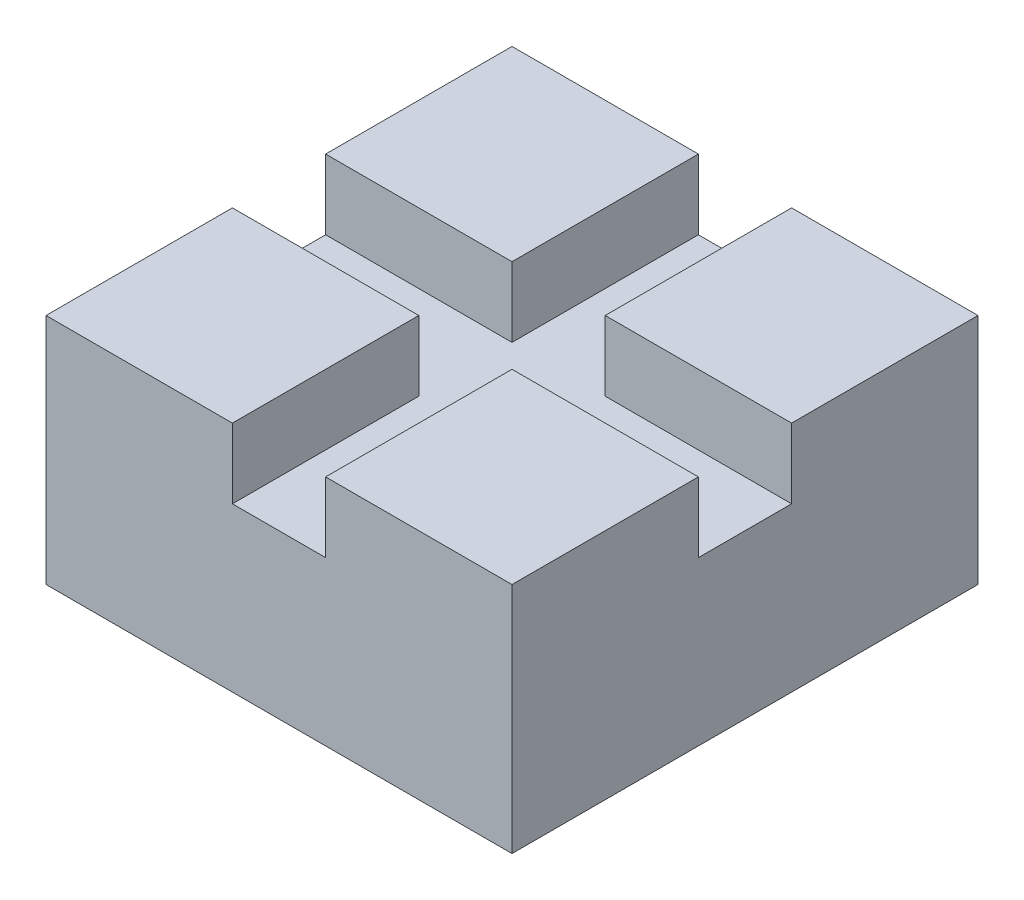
ISO-10303-21;
HEADER;
FILE_DESCRIPTION(('STEP AP214'),'2;1');
FILE_NAME('part.step','',(''),(''),'','','');
FILE_SCHEMA(('AUTOMOTIVE_DESIGN { 1 0 10303 214 1 1 1 1 }'));
ENDSEC;
DATA;
#1=APPLICATION_CONTEXT('core data for automotive mechanical design processes');
#2=APPLICATION_PROTOCOL_DEFINITION('international standard','automotive_design',2000,#1);
#3=PRODUCT_CONTEXT('',#1,'mechanical');
#4=PRODUCT('Part','Part','',(#3));
#5=PRODUCT_RELATED_PRODUCT_CATEGORY('part','',(#4));
#6=PRODUCT_DEFINITION_FORMATION('','',#4);
#7=PRODUCT_DEFINITION_CONTEXT('part definition',#1,'design');
#8=PRODUCT_DEFINITION('design','',#6,#7);
#9=PRODUCT_DEFINITION_SHAPE('','',#8);
#10=(LENGTH_UNIT() NAMED_UNIT(*) SI_UNIT(.MILLI.,.METRE.));
#11=(NAMED_UNIT(*) PLANE_ANGLE_UNIT() SI_UNIT($,.RADIAN.));
#12=(NAMED_UNIT(*) SI_UNIT($,.STERADIAN.) SOLID_ANGLE_UNIT());
#13=UNCERTAINTY_MEASURE_WITH_UNIT(LENGTH_MEASURE(1.E-05),#10,'distance_accuracy_value','');
#14=(GEOMETRIC_REPRESENTATION_CONTEXT(3) GLOBAL_UNCERTAINTY_ASSIGNED_CONTEXT((#13)) GLOBAL_UNIT_ASSIGNED_CONTEXT((#10,
#11,#12)) REPRESENTATION_CONTEXT('',''));
#15=CARTESIAN_POINT('',(0.,0.,0.));
#16=DIRECTION('',(0.,0.,1.));
#17=DIRECTION('',(1.,0.,0.));
#18=AXIS2_PLACEMENT_3D('',#15,#16,#17);
#19=CARTESIAN_POINT('',(0.,40.,0.));
#20=DIRECTION('',(0.,-1.,0.));
#21=DIRECTION('',(0.,0.,-1.));
#22=AXIS2_PLACEMENT_3D('',#19,#20,#21);
#23=PLANE('',#22);
#24=DIRECTION('',(0.,0.,1.));
#25=VECTOR('',#24,1.);
#26=CARTESIAN_POINT('',(-8.,40.,-8.));
#27=LINE('',#26,#25);
#28=CARTESIAN_POINT('',(-8.,40.,-40.));
#29=VERTEX_POINT('',#28);
#30=CARTESIAN_POINT('',(-8.,40.,-8.));
#31=VERTEX_POINT('',#30);
#32=EDGE_CURVE('E216',#29,#31,#27,.T.);
#33=ORIENTED_EDGE('',*,*,#32,.F.);
#34=DIRECTION('',(-1.,0.,0.));
#35=VECTOR('',#34,1.);
#36=CARTESIAN_POINT('',(-40.,40.,-40.));
#37=LINE('',#36,#35);
#38=CARTESIAN_POINT('',(-40.,40.,-40.));
#39=VERTEX_POINT('',#38);
#40=EDGE_CURVE('E257',#29,#39,#37,.T.);
#41=ORIENTED_EDGE('',*,*,#40,.T.);
#42=DIRECTION('',(0.,0.,1.));
#43=VECTOR('',#42,1.);
#44=CARTESIAN_POINT('',(-40.,40.,40.));
#45=LINE('',#44,#43);
#46=CARTESIAN_POINT('',(-40.,40.,-8.));
#47=VERTEX_POINT('',#46);
#48=EDGE_CURVE('E262',#39,#47,#45,.T.);
#49=ORIENTED_EDGE('',*,*,#48,.T.);
#50=DIRECTION('',(-1.,0.,0.));
#51=VECTOR('',#50,1.);
#52=CARTESIAN_POINT('',(-40.,40.,-8.));
#53=LINE('',#52,#51);
#54=EDGE_CURVE('E218',#31,#47,#53,.T.);
#55=ORIENTED_EDGE('',*,*,#54,.F.);
#56=EDGE_LOOP('',(#33,#41,#49,#55));
#57=FACE_BOUND('',#56,.T.);
#58=ADVANCED_FACE('F41',(#57),#23,.F.);
#59=DIRECTION('',(1.,0.,0.));
#60=VECTOR('',#59,1.);
#61=CARTESIAN_POINT('',(-8.,40.,8.));
#62=LINE('',#61,#60);
#63=CARTESIAN_POINT('',(-40.,40.,8.));
#64=VERTEX_POINT('',#63);
#65=CARTESIAN_POINT('',(-8.,40.,8.));
#66=VERTEX_POINT('',#65);
#67=EDGE_CURVE('E222',#64,#66,#62,.T.);
#68=ORIENTED_EDGE('',*,*,#67,.F.);
#69=CARTESIAN_POINT('',(-40.,40.,40.));
#70=VERTEX_POINT('',#69);
#71=EDGE_CURVE('E263',#64,#70,#45,.T.);
#72=ORIENTED_EDGE('',*,*,#71,.T.);
#73=DIRECTION('',(1.,0.,0.));
#74=VECTOR('',#73,1.);
#75=CARTESIAN_POINT('',(-40.,40.,40.));
#76=LINE('',#75,#74);
#77=CARTESIAN_POINT('',(-8.,40.,40.));
#78=VERTEX_POINT('',#77);
#79=EDGE_CURVE('E270',#70,#78,#76,.T.);
#80=ORIENTED_EDGE('',*,*,#79,.T.);
#81=DIRECTION('',(0.,0.,1.));
#82=VECTOR('',#81,1.);
#83=CARTESIAN_POINT('',(-8.,40.,40.));
#84=LINE('',#83,#82);
#85=EDGE_CURVE('E221',#66,#78,#84,.T.);
#86=ORIENTED_EDGE('',*,*,#85,.F.);
#87=EDGE_LOOP('',(#68,#72,#80,#86));
#88=FACE_BOUND('',#87,.T.);
#89=ADVANCED_FACE('F312',(#88),#23,.F.);
#90=DIRECTION('',(0.,0.,-1.));
#91=VECTOR('',#90,1.);
#92=CARTESIAN_POINT('',(8.,40.,8.));
#93=LINE('',#92,#91);
#94=CARTESIAN_POINT('',(8.,40.,40.));
#95=VERTEX_POINT('',#94);
#96=CARTESIAN_POINT('',(8.,40.,8.));
#97=VERTEX_POINT('',#96);
#98=EDGE_CURVE('E228',#95,#97,#93,.T.);
#99=ORIENTED_EDGE('',*,*,#98,.F.);
#100=CARTESIAN_POINT('',(40.,40.,40.));
#101=VERTEX_POINT('',#100);
#102=EDGE_CURVE('E61',#95,#101,#76,.T.);
#103=ORIENTED_EDGE('',*,*,#102,.T.);
#104=DIRECTION('',(0.,0.,-1.));
#105=VECTOR('',#104,1.);
#106=CARTESIAN_POINT('',(40.,40.,40.));
#107=LINE('',#106,#105);
#108=CARTESIAN_POINT('',(40.,40.,8.));
#109=VERTEX_POINT('',#108);
#110=EDGE_CURVE('E256',#101,#109,#107,.T.);
#111=ORIENTED_EDGE('',*,*,#110,.T.);
#112=DIRECTION('',(1.,0.,0.));
#113=VECTOR('',#112,1.);
#114=CARTESIAN_POINT('',(40.,40.,8.));
#115=LINE('',#114,#113);
#116=EDGE_CURVE('E230',#97,#109,#115,.T.);
#117=ORIENTED_EDGE('',*,*,#116,.F.);
#118=EDGE_LOOP('',(#99,#103,#111,#117));
#119=FACE_BOUND('',#118,.T.);
#120=ADVANCED_FACE('F301',(#119),#23,.F.);
#121=DIRECTION('',(0.,0.,-1.));
#122=VECTOR('',#121,1.);
#123=CARTESIAN_POINT('',(8.,40.,-40.));
#124=LINE('',#123,#122);
#125=CARTESIAN_POINT('',(8.,40.,-8.));
#126=VERTEX_POINT('',#125);
#127=CARTESIAN_POINT('',(8.,40.,-40.));
#128=VERTEX_POINT('',#127);
#129=EDGE_CURVE('E171',#126,#128,#124,.T.);
#130=ORIENTED_EDGE('',*,*,#129,.F.);
#131=DIRECTION('',(-1.,0.,0.));
#132=VECTOR('',#131,1.);
#133=CARTESIAN_POINT('',(8.,40.,-8.));
#134=LINE('',#133,#132);
#135=CARTESIAN_POINT('',(40.,40.,-8.));
#136=VERTEX_POINT('',#135);
#137=EDGE_CURVE('E189',#136,#126,#134,.T.);
#138=ORIENTED_EDGE('',*,*,#137,.F.);
#139=CARTESIAN_POINT('',(40.,40.,-40.));
#140=VERTEX_POINT('',#139);
#141=EDGE_CURVE('E92',#136,#140,#107,.T.);
#142=ORIENTED_EDGE('',*,*,#141,.T.);
#143=EDGE_CURVE('E261',#140,#128,#37,.T.);
#144=ORIENTED_EDGE('',*,*,#143,.T.);
#145=EDGE_LOOP('',(#130,#138,#142,#144));
#146=FACE_BOUND('',#145,.T.);
#147=ADVANCED_FACE('F306',(#146),#23,.F.);
#148=CARTESIAN_POINT('',(40.,40.,40.));
#149=DIRECTION('',(-1.,0.,0.));
#150=DIRECTION('',(0.,0.,1.));
#151=AXIS2_PLACEMENT_3D('',#148,#149,#150);
#152=PLANE('',#151);
#153=DIRECTION('',(0.,0.,-1.));
#154=VECTOR('',#153,1.);
#155=CARTESIAN_POINT('',(40.,28.,-8.));
#156=LINE('',#155,#154);
#157=CARTESIAN_POINT('',(40.,28.,8.));
#158=VERTEX_POINT('',#157);
#159=CARTESIAN_POINT('',(40.,28.,-8.));
#160=VERTEX_POINT('',#159);
#161=EDGE_CURVE('E215',#158,#160,#156,.T.);
#162=ORIENTED_EDGE('',*,*,#161,.F.);
#163=DIRECTION('',(0.,1.,0.));
#164=VECTOR('',#163,1.);
#165=CARTESIAN_POINT('',(40.,28.,8.));
#166=LINE('',#165,#164);
#167=EDGE_CURVE('E236',#158,#109,#166,.T.);
#168=ORIENTED_EDGE('',*,*,#167,.T.);
#169=ORIENTED_EDGE('',*,*,#110,.F.);
#170=DIRECTION('',(0.,-1.,0.));
#171=VECTOR('',#170,1.);
#172=CARTESIAN_POINT('',(40.,40.,40.));
#173=LINE('',#172,#171);
#174=CARTESIAN_POINT('',(40.,0.,40.));
#175=VERTEX_POINT('',#174);
#176=EDGE_CURVE('E269',#101,#175,#173,.T.);
#177=ORIENTED_EDGE('',*,*,#176,.T.);
#178=DIRECTION('',(0.,0.,-1.));
#179=VECTOR('',#178,1.);
#180=CARTESIAN_POINT('',(40.,0.,40.));
#181=LINE('',#180,#179);
#182=CARTESIAN_POINT('',(40.,0.,-40.));
#183=VERTEX_POINT('',#182);
#184=EDGE_CURVE('E235',#175,#183,#181,.T.);
#185=ORIENTED_EDGE('',*,*,#184,.T.);
#186=DIRECTION('',(0.,-1.,0.));
#187=VECTOR('',#186,1.);
#188=CARTESIAN_POINT('',(40.,40.,-40.));
#189=LINE('',#188,#187);
#190=EDGE_CURVE('E11',#140,#183,#189,.T.);
#191=ORIENTED_EDGE('',*,*,#190,.F.);
#192=ORIENTED_EDGE('',*,*,#141,.F.);
#193=DIRECTION('',(0.,1.,0.));
#194=VECTOR('',#193,1.);
#195=CARTESIAN_POINT('',(40.,28.,-8.));
#196=LINE('',#195,#194);
#197=EDGE_CURVE('E237',#160,#136,#196,.T.);
#198=ORIENTED_EDGE('',*,*,#197,.F.);
#199=EDGE_LOOP('',(#162,#168,#169,#177,#185,#191,#192,#198));
#200=FACE_BOUND('',#199,.T.);
#201=ADVANCED_FACE('F43',(#200),#152,.F.);
#202=CARTESIAN_POINT('',(-40.,40.,-40.));
#203=DIRECTION('',(0.,0.,1.));
#204=DIRECTION('',(1.,0.,0.));
#205=AXIS2_PLACEMENT_3D('',#202,#203,#204);
#206=PLANE('',#205);
#207=DIRECTION('',(-1.,0.,0.));
#208=VECTOR('',#207,1.);
#209=CARTESIAN_POINT('',(-8.,28.,-40.));
#210=LINE('',#209,#208);
#211=CARTESIAN_POINT('',(8.,28.,-40.));
#212=VERTEX_POINT('',#211);
#213=CARTESIAN_POINT('',(-8.,28.,-40.));
#214=VERTEX_POINT('',#213);
#215=EDGE_CURVE('E184',#212,#214,#210,.T.);
#216=ORIENTED_EDGE('',*,*,#215,.F.);
#217=DIRECTION('',(0.,1.,0.));
#218=VECTOR('',#217,1.);
#219=CARTESIAN_POINT('',(8.,28.,-40.));
#220=LINE('',#219,#218);
#221=EDGE_CURVE('E166',#212,#128,#220,.T.);
#222=ORIENTED_EDGE('',*,*,#221,.T.);
#223=ORIENTED_EDGE('',*,*,#143,.F.);
#224=ORIENTED_EDGE('',*,*,#190,.T.);
#225=DIRECTION('',(-1.,0.,0.));
#226=VECTOR('',#225,1.);
#227=CARTESIAN_POINT('',(-40.,0.,-40.));
#228=LINE('',#227,#226);
#229=CARTESIAN_POINT('',(-40.,0.,-40.));
#230=VERTEX_POINT('',#229);
#231=EDGE_CURVE('E272',#183,#230,#228,.T.);
#232=ORIENTED_EDGE('',*,*,#231,.T.);
#233=DIRECTION('',(0.,-1.,0.));
#234=VECTOR('',#233,1.);
#235=CARTESIAN_POINT('',(-40.,40.,-40.));
#236=LINE('',#235,#234);
#237=EDGE_CURVE('E47',#39,#230,#236,.T.);
#238=ORIENTED_EDGE('',*,*,#237,.F.);
#239=ORIENTED_EDGE('',*,*,#40,.F.);
#240=DIRECTION('',(0.,1.,0.));
#241=VECTOR('',#240,1.);
#242=CARTESIAN_POINT('',(-8.,28.,-40.));
#243=LINE('',#242,#241);
#244=EDGE_CURVE('E179',#214,#29,#243,.T.);
#245=ORIENTED_EDGE('',*,*,#244,.F.);
#246=EDGE_LOOP('',(#216,#222,#223,#224,#232,#238,#239,#245));
#247=FACE_BOUND('',#246,.T.);
#248=ADVANCED_FACE('F190',(#247),#206,.F.);
#249=CARTESIAN_POINT('',(-40.,40.,40.));
#250=DIRECTION('',(1.,0.,0.));
#251=DIRECTION('',(0.,0.,-1.));
#252=AXIS2_PLACEMENT_3D('',#249,#250,#251);
#253=PLANE('',#252);
#254=DIRECTION('',(0.,0.,1.));
#255=VECTOR('',#254,1.);
#256=CARTESIAN_POINT('',(-40.,28.,8.));
#257=LINE('',#256,#255);
#258=CARTESIAN_POINT('',(-40.,28.,-8.));
#259=VERTEX_POINT('',#258);
#260=CARTESIAN_POINT('',(-40.,28.,8.));
#261=VERTEX_POINT('',#260);
#262=EDGE_CURVE('E196',#259,#261,#257,.T.);
#263=ORIENTED_EDGE('',*,*,#262,.F.);
#264=DIRECTION('',(0.,1.,0.));
#265=VECTOR('',#264,1.);
#266=CARTESIAN_POINT('',(-40.,28.,-8.));
#267=LINE('',#266,#265);
#268=EDGE_CURVE('E252',#259,#47,#267,.T.);
#269=ORIENTED_EDGE('',*,*,#268,.T.);
#270=ORIENTED_EDGE('',*,*,#48,.F.);
#271=ORIENTED_EDGE('',*,*,#237,.T.);
#272=DIRECTION('',(0.,0.,1.));
#273=VECTOR('',#272,1.);
#274=CARTESIAN_POINT('',(-40.,0.,40.));
#275=LINE('',#274,#273);
#276=CARTESIAN_POINT('',(-40.,0.,40.));
#277=VERTEX_POINT('',#276);
#278=EDGE_CURVE('E274',#230,#277,#275,.T.);
#279=ORIENTED_EDGE('',*,*,#278,.T.);
#280=DIRECTION('',(0.,-1.,0.));
#281=VECTOR('',#280,1.);
#282=CARTESIAN_POINT('',(-40.,40.,40.));
#283=LINE('',#282,#281);
#284=EDGE_CURVE('E276',#70,#277,#283,.T.);
#285=ORIENTED_EDGE('',*,*,#284,.F.);
#286=ORIENTED_EDGE('',*,*,#71,.F.);
#287=DIRECTION('',(0.,1.,0.));
#288=VECTOR('',#287,1.);
#289=CARTESIAN_POINT('',(-40.,28.,8.));
#290=LINE('',#289,#288);
#291=EDGE_CURVE('E250',#261,#64,#290,.T.);
#292=ORIENTED_EDGE('',*,*,#291,.F.);
#293=EDGE_LOOP('',(#263,#269,#270,#271,#279,#285,#286,#292));
#294=FACE_BOUND('',#293,.T.);
#295=ADVANCED_FACE('F286',(#294),#253,.F.);
#296=CARTESIAN_POINT('',(-40.,40.,40.));
#297=DIRECTION('',(0.,0.,-1.));
#298=DIRECTION('',(-1.,0.,0.));
#299=AXIS2_PLACEMENT_3D('',#296,#297,#298);
#300=PLANE('',#299);
#301=DIRECTION('',(1.,0.,0.));
#302=VECTOR('',#301,1.);
#303=CARTESIAN_POINT('',(8.,28.,40.));
#304=LINE('',#303,#302);
#305=CARTESIAN_POINT('',(-8.,28.,40.));
#306=VERTEX_POINT('',#305);
#307=CARTESIAN_POINT('',(8.,28.,40.));
#308=VERTEX_POINT('',#307);
#309=EDGE_CURVE('E204',#306,#308,#304,.T.);
#310=ORIENTED_EDGE('',*,*,#309,.F.);
#311=DIRECTION('',(0.,1.,0.));
#312=VECTOR('',#311,1.);
#313=CARTESIAN_POINT('',(-8.,28.,40.));
#314=LINE('',#313,#312);
#315=EDGE_CURVE('E241',#306,#78,#314,.T.);
#316=ORIENTED_EDGE('',*,*,#315,.T.);
#317=ORIENTED_EDGE('',*,*,#79,.F.);
#318=ORIENTED_EDGE('',*,*,#284,.T.);
#319=DIRECTION('',(1.,0.,0.));
#320=VECTOR('',#319,1.);
#321=CARTESIAN_POINT('',(-40.,0.,40.));
#322=LINE('',#321,#320);
#323=EDGE_CURVE('E87',#277,#175,#322,.T.);
#324=ORIENTED_EDGE('',*,*,#323,.T.);
#325=ORIENTED_EDGE('',*,*,#176,.F.);
#326=ORIENTED_EDGE('',*,*,#102,.F.);
#327=DIRECTION('',(0.,1.,0.));
#328=VECTOR('',#327,1.);
#329=CARTESIAN_POINT('',(8.,28.,40.));
#330=LINE('',#329,#328);
#331=EDGE_CURVE('E242',#308,#95,#330,.T.);
#332=ORIENTED_EDGE('',*,*,#331,.F.);
#333=EDGE_LOOP('',(#310,#316,#317,#318,#324,#325,#326,#332));
#334=FACE_BOUND('',#333,.T.);
#335=ADVANCED_FACE('F298',(#334),#300,.F.);
#336=CARTESIAN_POINT('',(0.,0.,0.));
#337=DIRECTION('',(0.,-1.,0.));
#338=DIRECTION('',(0.,0.,-1.));
#339=AXIS2_PLACEMENT_3D('',#336,#337,#338);
#340=PLANE('',#339);
#341=ORIENTED_EDGE('',*,*,#184,.F.);
#342=ORIENTED_EDGE('',*,*,#323,.F.);
#343=ORIENTED_EDGE('',*,*,#278,.F.);
#344=ORIENTED_EDGE('',*,*,#231,.F.);
#345=EDGE_LOOP('',(#341,#342,#343,#344));
#346=FACE_BOUND('',#345,.T.);
#347=ADVANCED_FACE('F290',(#346),#340,.T.);
#348=CARTESIAN_POINT('',(8.,28.,-40.));
#349=DIRECTION('',(1.,0.,0.));
#350=DIRECTION('',(0.,0.,-1.));
#351=AXIS2_PLACEMENT_3D('',#348,#349,#350);
#352=PLANE('',#351);
#353=ORIENTED_EDGE('',*,*,#129,.T.);
#354=ORIENTED_EDGE('',*,*,#221,.F.);
#355=DIRECTION('',(0.,0.,-1.));
#356=VECTOR('',#355,1.);
#357=CARTESIAN_POINT('',(8.,28.,-40.));
#358=LINE('',#357,#356);
#359=CARTESIAN_POINT('',(8.,28.,-8.));
#360=VERTEX_POINT('',#359);
#361=EDGE_CURVE('E174',#360,#212,#358,.T.);
#362=ORIENTED_EDGE('',*,*,#361,.F.);
#363=DIRECTION('',(0.,1.,0.));
#364=VECTOR('',#363,1.);
#365=CARTESIAN_POINT('',(8.,28.,-8.));
#366=LINE('',#365,#364);
#367=EDGE_CURVE('E234',#360,#126,#366,.T.);
#368=ORIENTED_EDGE('',*,*,#367,.T.);
#369=EDGE_LOOP('',(#353,#354,#362,#368));
#370=FACE_BOUND('',#369,.T.);
#371=ADVANCED_FACE('F173',(#370),#352,.F.);
#372=CARTESIAN_POINT('',(8.,28.,-8.));
#373=DIRECTION('',(0.,0.,-1.));
#374=DIRECTION('',(-1.,0.,0.));
#375=AXIS2_PLACEMENT_3D('',#372,#373,#374);
#376=PLANE('',#375);
#377=ORIENTED_EDGE('',*,*,#137,.T.);
#378=ORIENTED_EDGE('',*,*,#367,.F.);
#379=DIRECTION('',(-1.,0.,0.));
#380=VECTOR('',#379,1.);
#381=CARTESIAN_POINT('',(8.,28.,-8.));
#382=LINE('',#381,#380);
#383=EDGE_CURVE('E178',#160,#360,#382,.T.);
#384=ORIENTED_EDGE('',*,*,#383,.F.);
#385=ORIENTED_EDGE('',*,*,#197,.T.);
#386=EDGE_LOOP('',(#377,#378,#384,#385));
#387=FACE_BOUND('',#386,.T.);
#388=ADVANCED_FACE('F307',(#387),#376,.F.);
#389=CARTESIAN_POINT('',(40.,28.,8.));
#390=DIRECTION('',(0.,0.,1.));
#391=DIRECTION('',(1.,0.,0.));
#392=AXIS2_PLACEMENT_3D('',#389,#390,#391);
#393=PLANE('',#392);
#394=ORIENTED_EDGE('',*,*,#116,.T.);
#395=ORIENTED_EDGE('',*,*,#167,.F.);
#396=DIRECTION('',(1.,0.,0.));
#397=VECTOR('',#396,1.);
#398=CARTESIAN_POINT('',(40.,28.,8.));
#399=LINE('',#398,#397);
#400=CARTESIAN_POINT('',(8.,28.,8.));
#401=VERTEX_POINT('',#400);
#402=EDGE_CURVE('E207',#401,#158,#399,.T.);
#403=ORIENTED_EDGE('',*,*,#402,.F.);
#404=DIRECTION('',(0.,1.,0.));
#405=VECTOR('',#404,1.);
#406=CARTESIAN_POINT('',(8.,28.,8.));
#407=LINE('',#406,#405);
#408=EDGE_CURVE('E243',#401,#97,#407,.T.);
#409=ORIENTED_EDGE('',*,*,#408,.T.);
#410=EDGE_LOOP('',(#394,#395,#403,#409));
#411=FACE_BOUND('',#410,.T.);
#412=ADVANCED_FACE('F304',(#411),#393,.F.);
#413=CARTESIAN_POINT('',(8.,28.,8.));
#414=DIRECTION('',(1.,0.,0.));
#415=DIRECTION('',(0.,0.,-1.));
#416=AXIS2_PLACEMENT_3D('',#413,#414,#415);
#417=PLANE('',#416);
#418=ORIENTED_EDGE('',*,*,#98,.T.);
#419=ORIENTED_EDGE('',*,*,#408,.F.);
#420=DIRECTION('',(0.,0.,-1.));
#421=VECTOR('',#420,1.);
#422=CARTESIAN_POINT('',(8.,28.,8.));
#423=LINE('',#422,#421);
#424=EDGE_CURVE('E206',#308,#401,#423,.T.);
#425=ORIENTED_EDGE('',*,*,#424,.F.);
#426=ORIENTED_EDGE('',*,*,#331,.T.);
#427=EDGE_LOOP('',(#418,#419,#425,#426));
#428=FACE_BOUND('',#427,.T.);
#429=ADVANCED_FACE('F300',(#428),#417,.F.);
#430=CARTESIAN_POINT('',(-8.,28.,40.));
#431=DIRECTION('',(-1.,0.,0.));
#432=DIRECTION('',(0.,0.,1.));
#433=AXIS2_PLACEMENT_3D('',#430,#431,#432);
#434=PLANE('',#433);
#435=ORIENTED_EDGE('',*,*,#85,.T.);
#436=ORIENTED_EDGE('',*,*,#315,.F.);
#437=DIRECTION('',(0.,0.,1.));
#438=VECTOR('',#437,1.);
#439=CARTESIAN_POINT('',(-8.,28.,40.));
#440=LINE('',#439,#438);
#441=CARTESIAN_POINT('',(-8.,28.,8.));
#442=VERTEX_POINT('',#441);
#443=EDGE_CURVE('E57',#442,#306,#440,.T.);
#444=ORIENTED_EDGE('',*,*,#443,.F.);
#445=DIRECTION('',(0.,1.,0.));
#446=VECTOR('',#445,1.);
#447=CARTESIAN_POINT('',(-8.,28.,8.));
#448=LINE('',#447,#446);
#449=EDGE_CURVE('E249',#442,#66,#448,.T.);
#450=ORIENTED_EDGE('',*,*,#449,.T.);
#451=EDGE_LOOP('',(#435,#436,#444,#450));
#452=FACE_BOUND('',#451,.T.);
#453=ADVANCED_FACE('F340',(#452),#434,.F.);
#454=CARTESIAN_POINT('',(-8.,28.,8.));
#455=DIRECTION('',(0.,0.,1.));
#456=DIRECTION('',(1.,0.,0.));
#457=AXIS2_PLACEMENT_3D('',#454,#455,#456);
#458=PLANE('',#457);
#459=ORIENTED_EDGE('',*,*,#67,.T.);
#460=ORIENTED_EDGE('',*,*,#449,.F.);
#461=DIRECTION('',(1.,0.,0.));
#462=VECTOR('',#461,1.);
#463=CARTESIAN_POINT('',(-8.,28.,8.));
#464=LINE('',#463,#462);
#465=EDGE_CURVE('E203',#261,#442,#464,.T.);
#466=ORIENTED_EDGE('',*,*,#465,.F.);
#467=ORIENTED_EDGE('',*,*,#291,.T.);
#468=EDGE_LOOP('',(#459,#460,#466,#467));
#469=FACE_BOUND('',#468,.T.);
#470=ADVANCED_FACE('F333',(#469),#458,.F.);
#471=CARTESIAN_POINT('',(-40.,28.,-8.));
#472=DIRECTION('',(0.,0.,-1.));
#473=DIRECTION('',(-1.,0.,0.));
#474=AXIS2_PLACEMENT_3D('',#471,#472,#473);
#475=PLANE('',#474);
#476=ORIENTED_EDGE('',*,*,#54,.T.);
#477=ORIENTED_EDGE('',*,*,#268,.F.);
#478=DIRECTION('',(-1.,0.,0.));
#479=VECTOR('',#478,1.);
#480=CARTESIAN_POINT('',(-40.,28.,-8.));
#481=LINE('',#480,#479);
#482=CARTESIAN_POINT('',(-8.,28.,-8.));
#483=VERTEX_POINT('',#482);
#484=EDGE_CURVE('E194',#483,#259,#481,.T.);
#485=ORIENTED_EDGE('',*,*,#484,.F.);
#486=DIRECTION('',(0.,1.,0.));
#487=VECTOR('',#486,1.);
#488=CARTESIAN_POINT('',(-8.,28.,-8.));
#489=LINE('',#488,#487);
#490=EDGE_CURVE('E254',#483,#31,#489,.T.);
#491=ORIENTED_EDGE('',*,*,#490,.T.);
#492=EDGE_LOOP('',(#476,#477,#485,#491));
#493=FACE_BOUND('',#492,.T.);
#494=ADVANCED_FACE('F347',(#493),#475,.F.);
#495=CARTESIAN_POINT('',(-8.,28.,-8.));
#496=DIRECTION('',(-1.,0.,0.));
#497=DIRECTION('',(0.,0.,1.));
#498=AXIS2_PLACEMENT_3D('',#495,#496,#497);
#499=PLANE('',#498);
#500=ORIENTED_EDGE('',*,*,#32,.T.);
#501=ORIENTED_EDGE('',*,*,#490,.F.);
#502=DIRECTION('',(0.,0.,1.));
#503=VECTOR('',#502,1.);
#504=CARTESIAN_POINT('',(-8.,28.,-8.));
#505=LINE('',#504,#503);
#506=EDGE_CURVE('E191',#214,#483,#505,.T.);
#507=ORIENTED_EDGE('',*,*,#506,.F.);
#508=ORIENTED_EDGE('',*,*,#244,.T.);
#509=EDGE_LOOP('',(#500,#501,#507,#508));
#510=FACE_BOUND('',#509,.T.);
#511=ADVANCED_FACE('F327',(#510),#499,.F.);
#512=CARTESIAN_POINT('',(0.,28.,0.));
#513=DIRECTION('',(0.,1.,0.));
#514=DIRECTION('',(0.,0.,1.));
#515=AXIS2_PLACEMENT_3D('',#512,#513,#514);
#516=PLANE('',#515);
#517=ORIENTED_EDGE('',*,*,#361,.T.);
#518=ORIENTED_EDGE('',*,*,#215,.T.);
#519=ORIENTED_EDGE('',*,*,#506,.T.);
#520=ORIENTED_EDGE('',*,*,#484,.T.);
#521=ORIENTED_EDGE('',*,*,#262,.T.);
#522=ORIENTED_EDGE('',*,*,#465,.T.);
#523=ORIENTED_EDGE('',*,*,#443,.T.);
#524=ORIENTED_EDGE('',*,*,#309,.T.);
#525=ORIENTED_EDGE('',*,*,#424,.T.);
#526=ORIENTED_EDGE('',*,*,#402,.T.);
#527=ORIENTED_EDGE('',*,*,#161,.T.);
#528=ORIENTED_EDGE('',*,*,#383,.T.);
#529=EDGE_LOOP('',(#517,#518,#519,#520,#521,#522,#523,#524,#525,#526,#527,#528));
#530=FACE_BOUND('',#529,.T.);
#531=ADVANCED_FACE('F185',(#530),#516,.T.);
#532=CLOSED_SHELL('',(#58,#89,#120,#147,#201,#248,#295,#335,#347,#371,#388,#412,#429,#453,#470,
#494,#511,#531));
#533=MANIFOLD_SOLID_BREP('B2',#532);
#534=ADVANCED_BREP_SHAPE_REPRESENTATION('',(#18,#533),#14);
#535=SHAPE_DEFINITION_REPRESENTATION(#9,#534);
ENDSEC;
END-ISO-10303-21;
